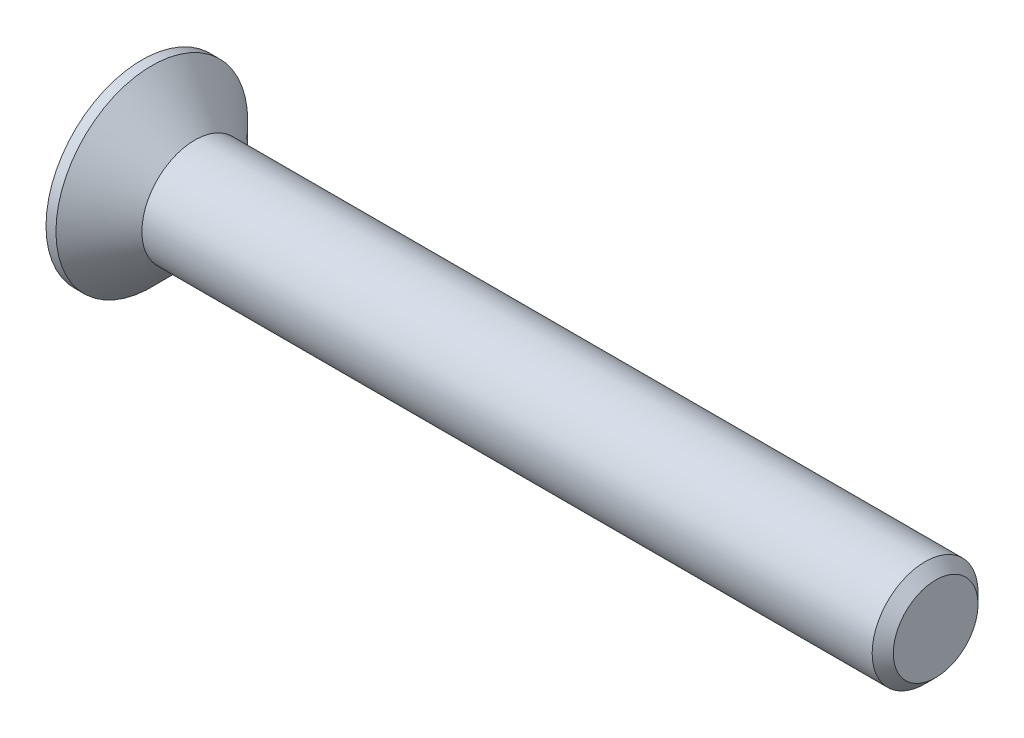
from build123d import *

# Parameters (mm, degrees)
CHAMFER1_SIZE      = 0.8
CUT_EXTRUDE1_DEPTH = 3.45


with BuildPart() as part:
    # Sketch1 → Revolve1 (revolve)
    with BuildSketch(Plane.XY, mode=Mode.PRIVATE) as revolve1_sk:
        Polygon((-4, 7.25), (-4, 0), (56, 0), (56, 4), (0, 4), (-3.25, 7.25), align=None)
    revolve(revolve1_sk.sketch.rotate(Axis((-4, 0, 0), (1, 0, 0)), 90), axis=Axis((-4, 0, 0), (1, 0, 0)))

    # Chamfer1
    chamfer1_edges = [part.edges().sort_by_distance(p)[0] for p in [
        (56, 0, -4),
    ]]
    chamfer(chamfer1_edges, length=CHAMFER1_SIZE)

    # Sketch2 → Cut-Extrude1 (cut)
    with BuildSketch(Plane.ZY.offset(4)):
        Polygon((-1.09, 4.35), (1.09, 4.35), (1.09, 1.09), (4.35, 1.09), (4.35, -1.09), (1.09, -1.09), (1.09, -4.35), (-1.09, -4.35), (-1.09, -1.09), (-4.35, -1.09), (-4.35, 1.09), (-1.09, 1.09), align=None)
    extrude(amount=-CUT_EXTRUDE1_DEPTH, mode=Mode.SUBTRACT)


solid = part.part
